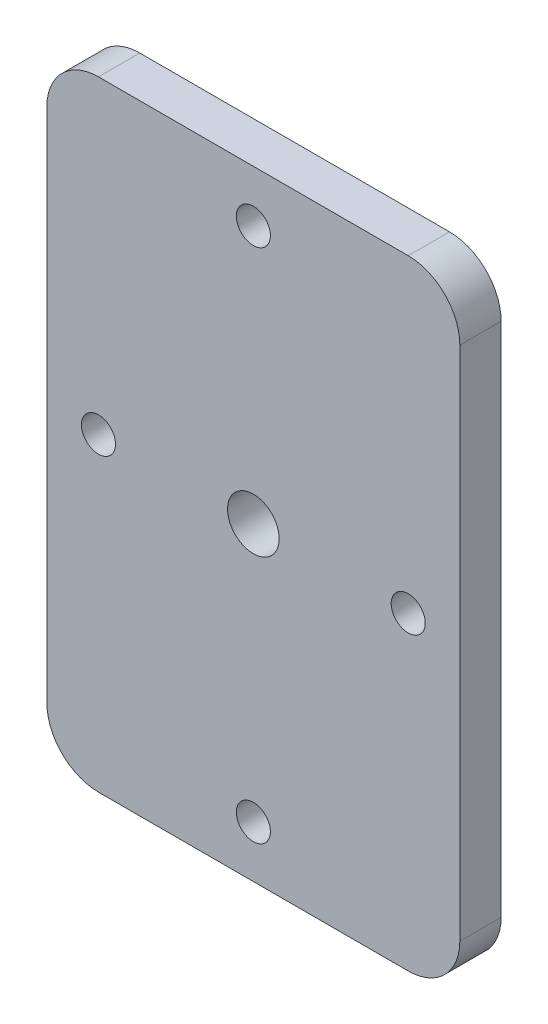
from build123d import *

# Parameters (mm, degrees)
EXTRUDE_1_DEPTH    = 4
HOLE_WIZARD_M4_1_D = 3.3
HOLE_WIZARD_M6_1_D = 5


with BuildPart() as part:
    # Sketch 1 → Extrude 1 (new body)
    with BuildSketch(Plane.XY):
        with BuildLine():
            Line((45, -25), (45, 25))
            ThreePointArc((45, 25), (43.535533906, 28.535533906), (40, 30))
            Line((40, 30), (10, 30))
            ThreePointArc((10, 30), (6.464466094, 28.535533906), (5, 25))
            Line((5, 25), (5, -25))
            ThreePointArc((5, -25), (6.464466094, -28.535533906), (10, -30))
            Line((10, -30), (40, -30))
            ThreePointArc((40, -30), (43.535533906, -28.535533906), (45, -25))
        make_face()
    extrude(amount=EXTRUDE_1_DEPTH)

    # Hole Wizard M4 _1 (through all)
    with Locations(Plane.XY.offset(4)):
        with Locations((40, 0), (25, 25), (25, -25), (10, 0)):
            Hole(HOLE_WIZARD_M4_1_D / 2)

    # Hole Wizard M6 _1 (through all)
    with Locations(Plane(origin=(25, 0, 4), x_dir=(1, 0, 0), z_dir=(0, 0, 1))):
        with Locations((0, 0)):
            Hole(HOLE_WIZARD_M6_1_D / 2)


solid = part.part
